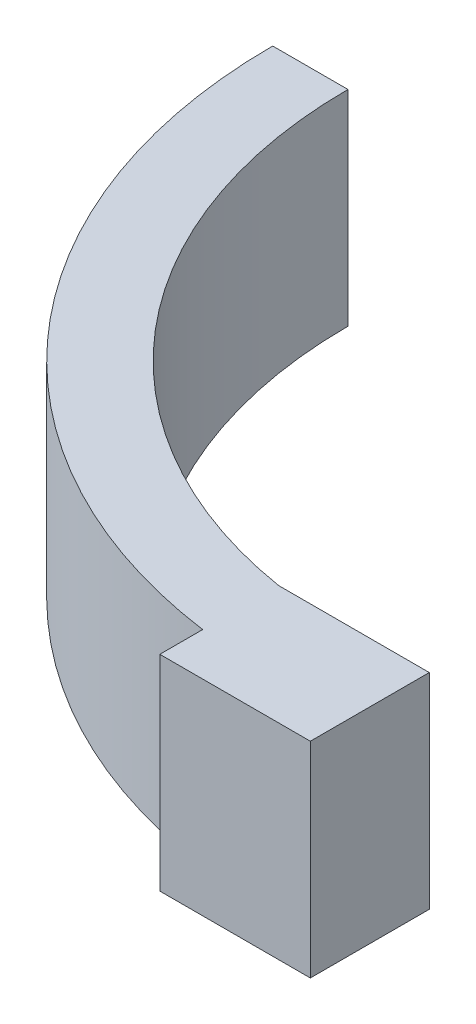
ISO-10303-21;
HEADER;
FILE_DESCRIPTION(('STEP AP214'),'2;1');
FILE_NAME('part.step','',(''),(''),'','','');
FILE_SCHEMA(('AUTOMOTIVE_DESIGN { 1 0 10303 214 1 1 1 1 }'));
ENDSEC;
DATA;
#1=APPLICATION_CONTEXT('core data for automotive mechanical design processes');
#2=APPLICATION_PROTOCOL_DEFINITION('international standard','automotive_design',2000,#1);
#3=PRODUCT_CONTEXT('',#1,'mechanical');
#4=PRODUCT('Part','Part','',(#3));
#5=PRODUCT_RELATED_PRODUCT_CATEGORY('part','',(#4));
#6=PRODUCT_DEFINITION_FORMATION('','',#4);
#7=PRODUCT_DEFINITION_CONTEXT('part definition',#1,'design');
#8=PRODUCT_DEFINITION('design','',#6,#7);
#9=PRODUCT_DEFINITION_SHAPE('','',#8);
#10=(LENGTH_UNIT() NAMED_UNIT(*) SI_UNIT(.MILLI.,.METRE.));
#11=(NAMED_UNIT(*) PLANE_ANGLE_UNIT() SI_UNIT($,.RADIAN.));
#12=(NAMED_UNIT(*) SI_UNIT($,.STERADIAN.) SOLID_ANGLE_UNIT());
#13=UNCERTAINTY_MEASURE_WITH_UNIT(LENGTH_MEASURE(1.E-05),#10,'distance_accuracy_value','');
#14=(GEOMETRIC_REPRESENTATION_CONTEXT(3) GLOBAL_UNCERTAINTY_ASSIGNED_CONTEXT((#13)) GLOBAL_UNIT_ASSIGNED_CONTEXT((#10,
#11,#12)) REPRESENTATION_CONTEXT('',''));
#15=CARTESIAN_POINT('',(0.,0.,0.));
#16=DIRECTION('',(0.,0.,1.));
#17=DIRECTION('',(1.,0.,0.));
#18=AXIS2_PLACEMENT_3D('',#15,#16,#17);
#19=CARTESIAN_POINT('',(0.,54.5,-125.));
#20=DIRECTION('',(0.,-1.,0.));
#21=DIRECTION('',(0.,0.,-1.));
#22=AXIS2_PLACEMENT_3D('',#19,#20,#21);
#23=CYLINDRICAL_SURFACE('',#22,145.);
#24=CARTESIAN_POINT('',(0.,54.5,-125.));
#25=DIRECTION('',(0.,1.,0.));
#26=DIRECTION('',(0.,0.,1.));
#27=AXIS2_PLACEMENT_3D('',#24,#25,#26);
#28=CIRCLE('',#27,145.);
#29=CARTESIAN_POINT('',(-145.,54.500003,-125.));
#30=VERTEX_POINT('',#29);
#31=CARTESIAN_POINT('',(-20.,54.5,18.6140661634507));
#32=VERTEX_POINT('',#31);
#33=EDGE_CURVE('E45',#30,#32,#28,.T.);
#34=ORIENTED_EDGE('',*,*,#33,.F.);
#35=DIRECTION('',(0.,1.,0.));
#36=VECTOR('',#35,1.);
#37=CARTESIAN_POINT('',(-145.,0.,-125.));
#38=LINE('',#37,#36);
#39=CARTESIAN_POINT('',(-145.,0.,-125.));
#40=VERTEX_POINT('',#39);
#41=EDGE_CURVE('E180',#40,#30,#38,.T.);
#42=ORIENTED_EDGE('',*,*,#41,.F.);
#43=CARTESIAN_POINT('',(0.,0.,-125.));
#44=DIRECTION('',(0.,1.,0.));
#45=DIRECTION('',(0.,0.,1.));
#46=AXIS2_PLACEMENT_3D('',#43,#44,#45);
#47=CIRCLE('',#46,145.);
#48=CARTESIAN_POINT('',(-20.,0.,18.6140661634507));
#49=VERTEX_POINT('',#48);
#50=EDGE_CURVE('E191',#40,#49,#47,.T.);
#51=ORIENTED_EDGE('',*,*,#50,.T.);
#52=DIRECTION('',(0.,-1.,0.));
#53=VECTOR('',#52,1.);
#54=CARTESIAN_POINT('',(-20.,54.5,18.6140661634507));
#55=LINE('',#54,#53);
#56=EDGE_CURVE('E11',#32,#49,#55,.T.);
#57=ORIENTED_EDGE('',*,*,#56,.F.);
#58=EDGE_LOOP('',(#34,#42,#51,#57));
#59=FACE_BOUND('',#58,.T.);
#60=ADVANCED_FACE('F42',(#59),#23,.T.);
#61=CARTESIAN_POINT('',(-20.,54.5,18.6140661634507));
#62=DIRECTION('',(1.,0.,0.));
#63=DIRECTION('',(0.,0.,-1.));
#64=AXIS2_PLACEMENT_3D('',#61,#62,#63);
#65=PLANE('',#64);
#66=DIRECTION('',(0.,0.,1.));
#67=VECTOR('',#66,1.);
#68=CARTESIAN_POINT('',(-20.,0.,18.6140661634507));
#69=LINE('',#68,#67);
#70=CARTESIAN_POINT('',(-20.,0.,30.));
#71=VERTEX_POINT('',#70);
#72=EDGE_CURVE('E213',#49,#71,#69,.T.);
#73=ORIENTED_EDGE('',*,*,#72,.T.);
#74=DIRECTION('',(0.,-1.,0.));
#75=VECTOR('',#74,1.);
#76=CARTESIAN_POINT('',(-20.,54.5,30.));
#77=LINE('',#76,#75);
#78=CARTESIAN_POINT('',(-20.,54.5,30.));
#79=VERTEX_POINT('',#78);
#80=EDGE_CURVE('E52',#79,#71,#77,.T.);
#81=ORIENTED_EDGE('',*,*,#80,.F.);
#82=DIRECTION('',(0.,0.,1.));
#83=VECTOR('',#82,1.);
#84=CARTESIAN_POINT('',(-20.,54.5,18.6140661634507));
#85=LINE('',#84,#83);
#86=EDGE_CURVE('E194',#32,#79,#85,.T.);
#87=ORIENTED_EDGE('',*,*,#86,.F.);
#88=ORIENTED_EDGE('',*,*,#56,.T.);
#89=EDGE_LOOP('',(#73,#81,#87,#88));
#90=FACE_BOUND('',#89,.T.);
#91=ADVANCED_FACE('F271',(#90),#65,.F.);
#92=CARTESIAN_POINT('',(20.,54.5,30.));
#93=DIRECTION('',(0.,0.,-1.));
#94=DIRECTION('',(-1.,0.,0.));
#95=AXIS2_PLACEMENT_3D('',#92,#93,#94);
#96=PLANE('',#95);
#97=DIRECTION('',(1.,0.,0.));
#98=VECTOR('',#97,1.);
#99=CARTESIAN_POINT('',(20.,0.,30.));
#100=LINE('',#99,#98);
#101=CARTESIAN_POINT('',(20.,0.,30.));
#102=VERTEX_POINT('',#101);
#103=EDGE_CURVE('E216',#71,#102,#100,.T.);
#104=ORIENTED_EDGE('',*,*,#103,.T.);
#105=DIRECTION('',(0.,-1.,0.));
#106=VECTOR('',#105,1.);
#107=CARTESIAN_POINT('',(20.,54.5,30.));
#108=LINE('',#107,#106);
#109=CARTESIAN_POINT('',(20.,54.5,30.));
#110=VERTEX_POINT('',#109);
#111=EDGE_CURVE('E237',#110,#102,#108,.T.);
#112=ORIENTED_EDGE('',*,*,#111,.F.);
#113=DIRECTION('',(1.,0.,0.));
#114=VECTOR('',#113,1.);
#115=CARTESIAN_POINT('',(20.,54.5,30.));
#116=LINE('',#115,#114);
#117=EDGE_CURVE('E197',#79,#110,#116,.T.);
#118=ORIENTED_EDGE('',*,*,#117,.F.);
#119=ORIENTED_EDGE('',*,*,#80,.T.);
#120=EDGE_LOOP('',(#104,#112,#118,#119));
#121=FACE_BOUND('',#120,.T.);
#122=ADVANCED_FACE('F247',(#121),#96,.F.);
#123=CARTESIAN_POINT('',(20.,54.5,-1.61037320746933));
#124=DIRECTION('',(-1.,0.,0.));
#125=DIRECTION('',(0.,0.,1.));
#126=AXIS2_PLACEMENT_3D('',#123,#124,#125);
#127=PLANE('',#126);
#128=DIRECTION('',(0.,0.,-1.));
#129=VECTOR('',#128,1.);
#130=CARTESIAN_POINT('',(20.,0.,-1.61037320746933));
#131=LINE('',#130,#129);
#132=CARTESIAN_POINT('',(20.,0.,-1.61037320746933));
#133=VERTEX_POINT('',#132);
#134=EDGE_CURVE('E220',#102,#133,#131,.T.);
#135=ORIENTED_EDGE('',*,*,#134,.T.);
#136=DIRECTION('',(0.,-1.,0.));
#137=VECTOR('',#136,1.);
#138=CARTESIAN_POINT('',(20.,54.5,-1.61037320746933));
#139=LINE('',#138,#137);
#140=CARTESIAN_POINT('',(20.,54.5,-1.61037320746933));
#141=VERTEX_POINT('',#140);
#142=EDGE_CURVE('E233',#141,#133,#139,.T.);
#143=ORIENTED_EDGE('',*,*,#142,.F.);
#144=DIRECTION('',(0.,0.,-1.));
#145=VECTOR('',#144,1.);
#146=CARTESIAN_POINT('',(20.,54.5,0.));
#147=LINE('',#146,#145);
#148=EDGE_CURVE('E200',#110,#141,#147,.T.);
#149=ORIENTED_EDGE('',*,*,#148,.F.);
#150=ORIENTED_EDGE('',*,*,#111,.T.);
#151=EDGE_LOOP('',(#135,#143,#149,#150));
#152=FACE_BOUND('',#151,.T.);
#153=ADVANCED_FACE('F259',(#152),#127,.F.);
#154=CARTESIAN_POINT('',(-20.,54.5,-1.61037320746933));
#155=DIRECTION('',(0.,0.,1.));
#156=DIRECTION('',(1.,0.,0.));
#157=AXIS2_PLACEMENT_3D('',#154,#155,#156);
#158=PLANE('',#157);
#159=DIRECTION('',(-1.,0.,0.));
#160=VECTOR('',#159,1.);
#161=CARTESIAN_POINT('',(-20.,0.,-1.61037320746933));
#162=LINE('',#161,#160);
#163=CARTESIAN_POINT('',(-20.0000000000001,0.,-1.61037320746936));
#164=VERTEX_POINT('',#163);
#165=EDGE_CURVE('E223',#133,#164,#162,.T.);
#166=ORIENTED_EDGE('',*,*,#165,.T.);
#167=DIRECTION('',(0.,-1.,0.));
#168=VECTOR('',#167,1.);
#169=CARTESIAN_POINT('',(-20.0000000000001,54.5,-1.61037320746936));
#170=LINE('',#169,#168);
#171=CARTESIAN_POINT('',(-20.0000000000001,54.5,-1.61037320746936));
#172=VERTEX_POINT('',#171);
#173=EDGE_CURVE('E210',#172,#164,#170,.T.);
#174=ORIENTED_EDGE('',*,*,#173,.F.);
#175=DIRECTION('',(-1.,0.,0.));
#176=VECTOR('',#175,1.);
#177=CARTESIAN_POINT('',(-20.,54.5,-1.61037320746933));
#178=LINE('',#177,#176);
#179=EDGE_CURVE('E203',#141,#172,#178,.T.);
#180=ORIENTED_EDGE('',*,*,#179,.F.);
#181=ORIENTED_EDGE('',*,*,#142,.T.);
#182=EDGE_LOOP('',(#166,#174,#180,#181));
#183=FACE_BOUND('',#182,.T.);
#184=ADVANCED_FACE('F263',(#183),#158,.F.);
#185=CARTESIAN_POINT('',(0.,54.5,-125.));
#186=DIRECTION('',(0.,-1.,0.));
#187=DIRECTION('',(0.,0.,-1.));
#188=AXIS2_PLACEMENT_3D('',#185,#186,#187);
#189=CYLINDRICAL_SURFACE('',#188,125.);
#190=CARTESIAN_POINT('',(0.,0.,-125.));
#191=DIRECTION('',(0.,-1.,0.));
#192=DIRECTION('',(0.,0.,1.));
#193=AXIS2_PLACEMENT_3D('',#190,#191,#192);
#194=CIRCLE('',#193,125.);
#195=CARTESIAN_POINT('',(-125.,0.,-125.));
#196=VERTEX_POINT('',#195);
#197=EDGE_CURVE('E226',#164,#196,#194,.T.);
#198=ORIENTED_EDGE('',*,*,#197,.T.);
#199=DIRECTION('',(0.,-1.,0.));
#200=VECTOR('',#199,1.);
#201=CARTESIAN_POINT('',(-125.,54.5,-125.));
#202=LINE('',#201,#200);
#203=CARTESIAN_POINT('',(-125.,54.5,-125.));
#204=VERTEX_POINT('',#203);
#205=EDGE_CURVE('E67',#196,#204,#202,.F.);
#206=ORIENTED_EDGE('',*,*,#205,.T.);
#207=CARTESIAN_POINT('',(0.,54.5,-125.));
#208=DIRECTION('',(0.,-1.,0.));
#209=DIRECTION('',(0.,0.,1.));
#210=AXIS2_PLACEMENT_3D('',#207,#208,#209);
#211=CIRCLE('',#210,125.);
#212=EDGE_CURVE('E206',#172,#204,#211,.T.);
#213=ORIENTED_EDGE('',*,*,#212,.F.);
#214=ORIENTED_EDGE('',*,*,#173,.T.);
#215=EDGE_LOOP('',(#198,#206,#213,#214));
#216=FACE_BOUND('',#215,.T.);
#217=ADVANCED_FACE('F275',(#216),#189,.F.);
#218=CARTESIAN_POINT('',(0.,54.5,-125.));
#219=DIRECTION('',(0.,1.,0.));
#220=DIRECTION('',(0.,0.,1.));
#221=AXIS2_PLACEMENT_3D('',#218,#219,#220);
#222=PLANE('',#221);
#223=DIRECTION('',(1.,0.,0.));
#224=VECTOR('',#223,1.);
#225=CARTESIAN_POINT('',(0.,54.5,-125.));
#226=LINE('',#225,#224);
#227=EDGE_CURVE('E183',#30,#204,#226,.T.);
#228=ORIENTED_EDGE('',*,*,#227,.F.);
#229=ORIENTED_EDGE('',*,*,#33,.T.);
#230=ORIENTED_EDGE('',*,*,#86,.T.);
#231=ORIENTED_EDGE('',*,*,#117,.T.);
#232=ORIENTED_EDGE('',*,*,#148,.T.);
#233=ORIENTED_EDGE('',*,*,#179,.T.);
#234=ORIENTED_EDGE('',*,*,#212,.T.);
#235=EDGE_LOOP('',(#228,#229,#230,#231,#232,#233,#234));
#236=FACE_BOUND('',#235,.T.);
#237=ADVANCED_FACE('F268',(#236),#222,.T.);
#238=CARTESIAN_POINT('',(0.,0.,-125.));
#239=DIRECTION('',(0.,1.,0.));
#240=DIRECTION('',(0.,0.,1.));
#241=AXIS2_PLACEMENT_3D('',#238,#239,#240);
#242=PLANE('',#241);
#243=ORIENTED_EDGE('',*,*,#50,.F.);
#244=DIRECTION('',(1.,0.,0.));
#245=VECTOR('',#244,1.);
#246=CARTESIAN_POINT('',(-145.,0.,-125.));
#247=LINE('',#246,#245);
#248=EDGE_CURVE('E172',#40,#196,#247,.T.);
#249=ORIENTED_EDGE('',*,*,#248,.T.);
#250=ORIENTED_EDGE('',*,*,#197,.F.);
#251=ORIENTED_EDGE('',*,*,#165,.F.);
#252=ORIENTED_EDGE('',*,*,#134,.F.);
#253=ORIENTED_EDGE('',*,*,#103,.F.);
#254=ORIENTED_EDGE('',*,*,#72,.F.);
#255=EDGE_LOOP('',(#243,#249,#250,#251,#252,#253,#254));
#256=FACE_BOUND('',#255,.T.);
#257=ADVANCED_FACE('F254',(#256),#242,.F.);
#258=CARTESIAN_POINT('',(-145.,0.,-125.));
#259=DIRECTION('',(0.,0.,1.));
#260=DIRECTION('',(1.,0.,0.));
#261=AXIS2_PLACEMENT_3D('',#258,#259,#260);
#262=PLANE('',#261);
#263=DIRECTION('',(-1.,0.,0.));
#264=VECTOR('',#263,1.);
#265=CARTESIAN_POINT('',(0.,35.2500015,-125.));
#266=LINE('',#265,#264);
#267=CARTESIAN_POINT('',(-127.5,35.2500015,-125.));
#268=VERTEX_POINT('',#267);
#269=CARTESIAN_POINT('',(-142.5,35.2500015,-125.));
#270=VERTEX_POINT('',#269);
#271=EDGE_CURVE('E163',#268,#270,#266,.T.);
#272=ORIENTED_EDGE('',*,*,#271,.T.);
#273=DIRECTION('',(0.,1.,0.));
#274=VECTOR('',#273,1.);
#275=CARTESIAN_POINT('',(-142.5,0.,-125.));
#276=LINE('',#275,#274);
#277=CARTESIAN_POINT('',(-142.5,19.2500015,-125.));
#278=VERTEX_POINT('',#277);
#279=EDGE_CURVE('E59',#278,#270,#276,.T.);
#280=ORIENTED_EDGE('',*,*,#279,.F.);
#281=DIRECTION('',(-1.,0.,0.));
#282=VECTOR('',#281,1.);
#283=CARTESIAN_POINT('',(0.,19.2500015,-125.));
#284=LINE('',#283,#282);
#285=CARTESIAN_POINT('',(-127.5,19.2500015,-125.));
#286=VERTEX_POINT('',#285);
#287=EDGE_CURVE('E150',#286,#278,#284,.T.);
#288=ORIENTED_EDGE('',*,*,#287,.F.);
#289=DIRECTION('',(0.,-1.,0.));
#290=VECTOR('',#289,1.);
#291=CARTESIAN_POINT('',(-127.5,0.,-125.));
#292=LINE('',#291,#290);
#293=EDGE_CURVE('E154',#268,#286,#292,.T.);
#294=ORIENTED_EDGE('',*,*,#293,.F.);
#295=EDGE_LOOP('',(#272,#280,#288,#294));
#296=FACE_BOUND('',#295,.T.);
#297=ORIENTED_EDGE('',*,*,#248,.F.);
#298=ORIENTED_EDGE('',*,*,#41,.T.);
#299=ORIENTED_EDGE('',*,*,#227,.T.);
#300=ORIENTED_EDGE('',*,*,#205,.F.);
#301=EDGE_LOOP('',(#297,#298,#299,#300));
#302=FACE_BOUND('',#301,.T.);
#303=ADVANCED_FACE('F322',(#296,#302),#262,.F.);
#304=CARTESIAN_POINT('',(-142.5,0.,-115.));
#305=DIRECTION('',(-1.,0.,0.));
#306=DIRECTION('',(0.,0.,1.));
#307=AXIS2_PLACEMENT_3D('',#304,#305,#306);
#308=PLANE('',#307);
#309=ORIENTED_EDGE('',*,*,#279,.T.);
#310=DIRECTION('',(0.,0.,-1.));
#311=VECTOR('',#310,1.);
#312=CARTESIAN_POINT('',(-142.5,35.2500015,-115.));
#313=LINE('',#312,#311);
#314=CARTESIAN_POINT('',(-142.5,35.2500015,-115.));
#315=VERTEX_POINT('',#314);
#316=EDGE_CURVE('E130',#315,#270,#313,.T.);
#317=ORIENTED_EDGE('',*,*,#316,.F.);
#318=DIRECTION('',(0.,1.,0.));
#319=VECTOR('',#318,1.);
#320=CARTESIAN_POINT('',(-142.5,0.,-115.));
#321=LINE('',#320,#319);
#322=CARTESIAN_POINT('',(-142.5,19.2500015,-115.));
#323=VERTEX_POINT('',#322);
#324=EDGE_CURVE('E139',#323,#315,#321,.T.);
#325=ORIENTED_EDGE('',*,*,#324,.F.);
#326=DIRECTION('',(0.,0.,-1.));
#327=VECTOR('',#326,1.);
#328=CARTESIAN_POINT('',(-142.5,19.2500015,-115.));
#329=LINE('',#328,#327);
#330=EDGE_CURVE('E169',#323,#278,#329,.T.);
#331=ORIENTED_EDGE('',*,*,#330,.T.);
#332=EDGE_LOOP('',(#309,#317,#325,#331));
#333=FACE_BOUND('',#332,.T.);
#334=ADVANCED_FACE('F142',(#333),#308,.F.);
#335=CARTESIAN_POINT('',(0.,19.2500015,-115.));
#336=DIRECTION('',(0.,-1.,0.));
#337=DIRECTION('',(0.,0.,-1.));
#338=AXIS2_PLACEMENT_3D('',#335,#336,#337);
#339=PLANE('',#338);
#340=ORIENTED_EDGE('',*,*,#287,.T.);
#341=ORIENTED_EDGE('',*,*,#330,.F.);
#342=DIRECTION('',(-1.,0.,0.));
#343=VECTOR('',#342,1.);
#344=CARTESIAN_POINT('',(0.,19.2500015,-115.));
#345=LINE('',#344,#343);
#346=CARTESIAN_POINT('',(-127.5,19.2500015,-115.));
#347=VERTEX_POINT('',#346);
#348=EDGE_CURVE('E145',#347,#323,#345,.T.);
#349=ORIENTED_EDGE('',*,*,#348,.F.);
#350=DIRECTION('',(0.,0.,-1.));
#351=VECTOR('',#350,1.);
#352=CARTESIAN_POINT('',(-127.5,19.2500015,-115.));
#353=LINE('',#352,#351);
#354=EDGE_CURVE('E173',#347,#286,#353,.T.);
#355=ORIENTED_EDGE('',*,*,#354,.T.);
#356=EDGE_LOOP('',(#340,#341,#349,#355));
#357=FACE_BOUND('',#356,.T.);
#358=ADVANCED_FACE('F341',(#357),#339,.F.);
#359=CARTESIAN_POINT('',(-127.5,0.,-115.));
#360=DIRECTION('',(1.,0.,0.));
#361=DIRECTION('',(0.,0.,-1.));
#362=AXIS2_PLACEMENT_3D('',#359,#360,#361);
#363=PLANE('',#362);
#364=ORIENTED_EDGE('',*,*,#293,.T.);
#365=ORIENTED_EDGE('',*,*,#354,.F.);
#366=DIRECTION('',(0.,-1.,0.));
#367=VECTOR('',#366,1.);
#368=CARTESIAN_POINT('',(-127.5,0.,-115.));
#369=LINE('',#368,#367);
#370=CARTESIAN_POINT('',(-127.5,35.2500015,-115.));
#371=VERTEX_POINT('',#370);
#372=EDGE_CURVE('E138',#371,#347,#369,.T.);
#373=ORIENTED_EDGE('',*,*,#372,.F.);
#374=DIRECTION('',(0.,0.,-1.));
#375=VECTOR('',#374,1.);
#376=CARTESIAN_POINT('',(-127.5,35.2500015,-115.));
#377=LINE('',#376,#375);
#378=EDGE_CURVE('E132',#371,#268,#377,.T.);
#379=ORIENTED_EDGE('',*,*,#378,.T.);
#380=EDGE_LOOP('',(#364,#365,#373,#379));
#381=FACE_BOUND('',#380,.T.);
#382=ADVANCED_FACE('F347',(#381),#363,.F.);
#383=CARTESIAN_POINT('',(0.,35.2500015,-115.));
#384=DIRECTION('',(0.,-1.,0.));
#385=DIRECTION('',(0.,0.,-1.));
#386=AXIS2_PLACEMENT_3D('',#383,#384,#385);
#387=PLANE('',#386);
#388=ORIENTED_EDGE('',*,*,#271,.F.);
#389=ORIENTED_EDGE('',*,*,#378,.F.);
#390=DIRECTION('',(-1.,0.,0.));
#391=VECTOR('',#390,1.);
#392=CARTESIAN_POINT('',(0.,35.2500015,-115.));
#393=LINE('',#392,#391);
#394=EDGE_CURVE('E127',#371,#315,#393,.T.);
#395=ORIENTED_EDGE('',*,*,#394,.T.);
#396=ORIENTED_EDGE('',*,*,#316,.T.);
#397=EDGE_LOOP('',(#388,#389,#395,#396));
#398=FACE_BOUND('',#397,.T.);
#399=ADVANCED_FACE('F129',(#398),#387,.T.);
#400=CARTESIAN_POINT('',(0.,0.,-115.));
#401=DIRECTION('',(0.,0.,-1.));
#402=DIRECTION('',(-1.,0.,0.));
#403=AXIS2_PLACEMENT_3D('',#400,#401,#402);
#404=PLANE('',#403);
#405=ORIENTED_EDGE('',*,*,#324,.T.);
#406=ORIENTED_EDGE('',*,*,#394,.F.);
#407=ORIENTED_EDGE('',*,*,#372,.T.);
#408=ORIENTED_EDGE('',*,*,#348,.T.);
#409=EDGE_LOOP('',(#405,#406,#407,#408));
#410=FACE_BOUND('',#409,.T.);
#411=ADVANCED_FACE('F147',(#410),#404,.T.);
#412=CLOSED_SHELL('',(#60,#91,#122,#153,#184,#217,#237,#257,#303,#334,#358,#382,#399,#411));
#413=MANIFOLD_SOLID_BREP('B2',#412);
#414=ADVANCED_BREP_SHAPE_REPRESENTATION('',(#18,#413),#14);
#415=SHAPE_DEFINITION_REPRESENTATION(#9,#414);
ENDSEC;
END-ISO-10303-21;
